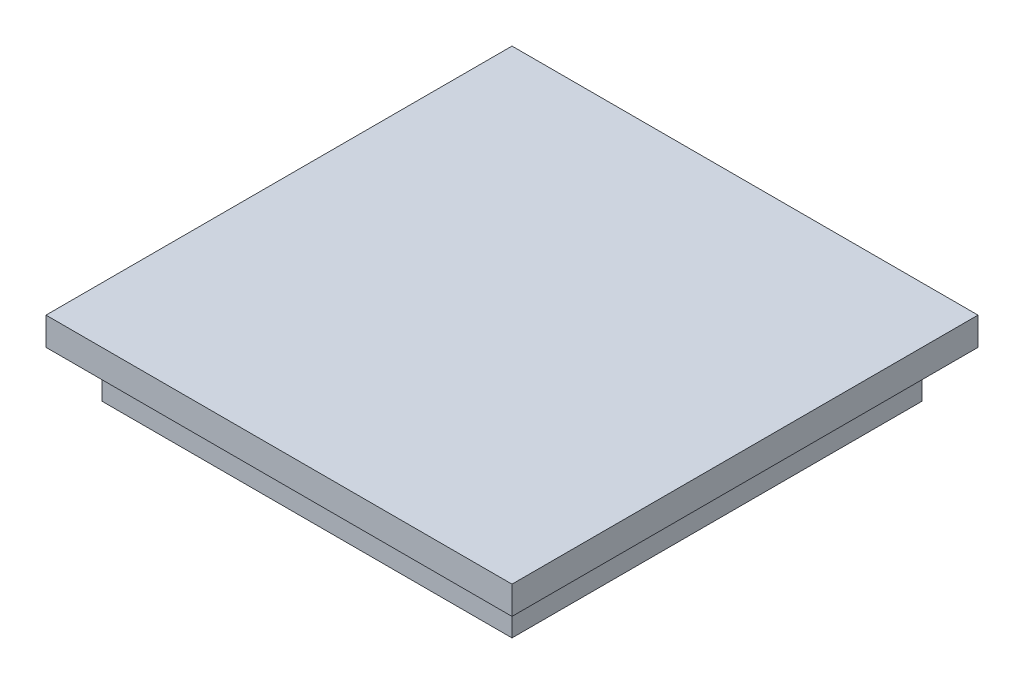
from build123d import *

# Parameters (mm, degrees)
ESQUISSE1_W      = 50
ESQUISSE1_H      = 50
EXTRUSION1_DEPTH = 3
ESQUISSE2_W      = 44
ESQUISSE2_H      = 44
ESQUISSE2_W_2    = 40
ESQUISSE2_H_2    = 40
EXTRUSION2_DEPTH = 5


with BuildPart() as part:
    # Esquisse1 → Extrusion1 (new body)
    with BuildSketch(Plane(origin=(0, 0, 0), x_dir=(1, 0, 0), z_dir=(0, 1, 0))):
        with Locations((25, 25)):
            Rectangle(ESQUISSE1_W, ESQUISSE1_H)
    extrude(amount=EXTRUSION1_DEPTH)

    # Esquisse2 → Extrusion2 (add)
    with BuildSketch(Plane.XZ):
        with Locations((25, -25)):
            Rectangle(ESQUISSE2_W, ESQUISSE2_H)
        with Locations((25, -25)):
            Rectangle(ESQUISSE2_W_2, ESQUISSE2_H_2, mode=Mode.SUBTRACT)
    extrude(amount=EXTRUSION2_DEPTH)


solid = part.part
